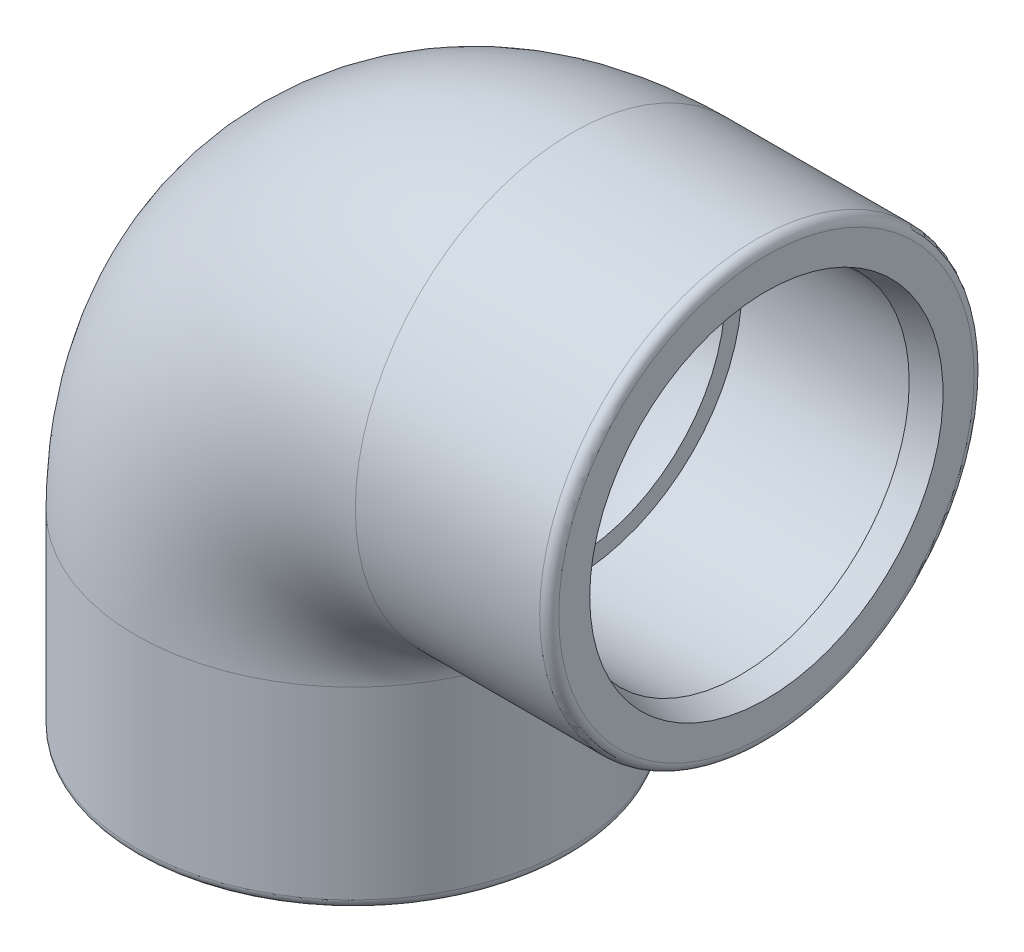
ISO-10303-21;
HEADER;
FILE_DESCRIPTION(('STEP AP214'),'2;1');
FILE_NAME('part.step','',(''),(''),'','','');
FILE_SCHEMA(('AUTOMOTIVE_DESIGN { 1 0 10303 214 1 1 1 1 }'));
ENDSEC;
DATA;
#1=APPLICATION_CONTEXT('core data for automotive mechanical design processes');
#2=APPLICATION_PROTOCOL_DEFINITION('international standard','automotive_design',2000,#1);
#3=PRODUCT_CONTEXT('',#1,'mechanical');
#4=PRODUCT('Part','Part','',(#3));
#5=PRODUCT_RELATED_PRODUCT_CATEGORY('part','',(#4));
#6=PRODUCT_DEFINITION_FORMATION('','',#4);
#7=PRODUCT_DEFINITION_CONTEXT('part definition',#1,'design');
#8=PRODUCT_DEFINITION('design','',#6,#7);
#9=PRODUCT_DEFINITION_SHAPE('','',#8);
#10=(LENGTH_UNIT() NAMED_UNIT(*) SI_UNIT(.MILLI.,.METRE.));
#11=(NAMED_UNIT(*) PLANE_ANGLE_UNIT() SI_UNIT($,.RADIAN.));
#12=(NAMED_UNIT(*) SI_UNIT($,.STERADIAN.) SOLID_ANGLE_UNIT());
#13=UNCERTAINTY_MEASURE_WITH_UNIT(LENGTH_MEASURE(1.E-05),#10,'distance_accuracy_value','');
#14=(GEOMETRIC_REPRESENTATION_CONTEXT(3) GLOBAL_UNCERTAINTY_ASSIGNED_CONTEXT((#13)) GLOBAL_UNIT_ASSIGNED_CONTEXT((#10,
#11,#12)) REPRESENTATION_CONTEXT('',''));
#15=CARTESIAN_POINT('',(0.,0.,0.));
#16=DIRECTION('',(0.,0.,1.));
#17=DIRECTION('',(1.,0.,0.));
#18=AXIS2_PLACEMENT_3D('',#15,#16,#17);
#19=CARTESIAN_POINT('',(-20.705,0.,0.));
#20=DIRECTION('',(0.,1.,0.));
#21=DIRECTION('',(0.,0.,-1.));
#22=AXIS2_PLACEMENT_3D('',#19,#20,#21);
#23=PLANE('',#22);
#24=CARTESIAN_POINT('',(-20.705,0.,0.));
#25=DIRECTION('',(0.,1.,0.));
#26=DIRECTION('',(1.,0.,0.));
#27=AXIS2_PLACEMENT_3D('',#24,#25,#26);
#28=CIRCLE('',#27,14.4);
#29=CARTESIAN_POINT('',(-35.105,0.,0.));
#30=VERTEX_POINT('',#29);
#31=EDGE_CURVE('E133',#30,#30,#28,.F.);
#32=ORIENTED_EDGE('',*,*,#31,.F.);
#33=EDGE_LOOP('',(#32));
#34=FACE_BOUND('',#33,.T.);
#35=CARTESIAN_POINT('',(-20.705,0.,0.));
#36=DIRECTION('',(0.,-1.,0.));
#37=DIRECTION('',(0.,0.,-1.));
#38=AXIS2_PLACEMENT_3D('',#35,#36,#37);
#39=CIRCLE('',#38,16.);
#40=CARTESIAN_POINT('',(-20.705,0.,-16.));
#41=VERTEX_POINT('',#40);
#42=EDGE_CURVE('E141',#41,#41,#39,.T.);
#43=ORIENTED_EDGE('',*,*,#42,.T.);
#44=EDGE_LOOP('',(#43));
#45=FACE_BOUND('',#44,.T.);
#46=ADVANCED_FACE('F43',(#34,#45),#23,.F.);
#47=CARTESIAN_POINT('',(18.295,20.705,0.));
#48=DIRECTION('',(-1.,0.,0.));
#49=DIRECTION('',(0.,0.,1.));
#50=AXIS2_PLACEMENT_3D('',#47,#48,#49);
#51=PLANE('',#50);
#52=CARTESIAN_POINT('',(18.295,20.705,0.));
#53=DIRECTION('',(-1.,0.,0.));
#54=DIRECTION('',(0.,0.,1.));
#55=AXIS2_PLACEMENT_3D('',#52,#53,#54);
#56=CIRCLE('',#55,19.6);
#57=CARTESIAN_POINT('',(18.295,20.705,19.6));
#58=VERTEX_POINT('',#57);
#59=EDGE_CURVE('E58',#58,#58,#56,.F.);
#60=ORIENTED_EDGE('',*,*,#59,.T.);
#61=EDGE_LOOP('',(#60));
#62=FACE_BOUND('',#61,.T.);
#63=CARTESIAN_POINT('',(18.295,20.705,0.));
#64=DIRECTION('',(-1.,0.,0.));
#65=DIRECTION('',(0.,0.,1.));
#66=AXIS2_PLACEMENT_3D('',#63,#64,#65);
#67=CIRCLE('',#66,16.675);
#68=CARTESIAN_POINT('',(18.295,20.705,16.675));
#69=VERTEX_POINT('',#68);
#70=EDGE_CURVE('E63',#69,#69,#67,.T.);
#71=ORIENTED_EDGE('',*,*,#70,.T.);
#72=EDGE_LOOP('',(#71));
#73=FACE_BOUND('',#72,.T.);
#74=ADVANCED_FACE('F163',(#62,#73),#51,.F.);
#75=CARTESIAN_POINT('',(0.,0.,0.));
#76=DIRECTION('',(0.,0.,-1.));
#77=DIRECTION('',(0.,-1.,0.));
#78=AXIS2_PLACEMENT_3D('',#75,#76,#77);
#79=TOROIDAL_SURFACE('',#78,20.705,20.5);
#80=CARTESIAN_POINT('',(-20.705,0.,0.));
#81=DIRECTION('',(0.,-1.,0.));
#82=DIRECTION('',(1.,0.,0.));
#83=AXIS2_PLACEMENT_3D('',#80,#81,#82);
#84=CIRCLE('',#83,20.5);
#85=CARTESIAN_POINT('',(-41.205,0.,0.));
#86=VERTEX_POINT('',#85);
#87=EDGE_CURVE('E80',#86,#86,#84,.T.);
#88=CARTESIAN_POINT('',(0.,20.705,0.));
#89=DIRECTION('',(1.,0.,0.));
#90=DIRECTION('',(0.,-1.,0.));
#91=AXIS2_PLACEMENT_3D('',#88,#89,#90);
#92=CIRCLE('',#91,20.5);
#93=CARTESIAN_POINT('',(0.,41.205,0.));
#94=VERTEX_POINT('',#93);
#95=EDGE_CURVE('E75',#94,#94,#92,.T.);
#96=CARTESIAN_POINT('',(0.,0.,0.));
#97=DIRECTION('',(0.,0.,-1.));
#98=DIRECTION('',(0.,-1.,0.));
#99=AXIS2_PLACEMENT_3D('',#96,#97,#98);
#100=CIRCLE('',#99,41.205);
#101=EDGE_CURVE('',#86,#94,#100,.T.);
#102=ORIENTED_EDGE('',*,*,#87,.F.);
#103=ORIENTED_EDGE('',*,*,#95,.F.);
#104=ORIENTED_EDGE('',*,*,#101,.T.);
#105=ORIENTED_EDGE('',*,*,#101,.F.);
#106=EDGE_LOOP('',(#102,#104,#103,#105));
#107=FACE_BOUND('',#106,.T.);
#108=ADVANCED_FACE('F169',(#107),#79,.T.);
#109=CARTESIAN_POINT('',(22.,20.705,0.));
#110=DIRECTION('',(-1.,0.,0.));
#111=DIRECTION('',(0.,-1.,0.));
#112=AXIS2_PLACEMENT_3D('',#109,#110,#111);
#113=CYLINDRICAL_SURFACE('',#112,20.5);
#114=CARTESIAN_POINT('',(17.395,20.705,0.));
#115=DIRECTION('',(-1.,0.,0.));
#116=DIRECTION('',(0.,0.,1.));
#117=AXIS2_PLACEMENT_3D('',#114,#115,#116);
#118=CIRCLE('',#117,20.5);
#119=CARTESIAN_POINT('',(17.395,20.705,20.5));
#120=VERTEX_POINT('',#119);
#121=EDGE_CURVE('E54',#120,#120,#118,.T.);
#122=ORIENTED_EDGE('',*,*,#121,.T.);
#123=EDGE_LOOP('',(#122));
#124=FACE_BOUND('',#123,.T.);
#125=ORIENTED_EDGE('',*,*,#95,.T.);
#126=EDGE_LOOP('',(#125));
#127=FACE_BOUND('',#126,.T.);
#128=ADVANCED_FACE('F182',(#124,#127),#113,.T.);
#129=CARTESIAN_POINT('',(22.,20.705,0.));
#130=DIRECTION('',(-1.,0.,0.));
#131=DIRECTION('',(0.,-1.,0.));
#132=AXIS2_PLACEMENT_3D('',#129,#130,#131);
#133=CYLINDRICAL_SURFACE('',#132,16.);
#134=CARTESIAN_POINT('',(15.7758657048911,20.705,0.));
#135=DIRECTION('',(-1.,0.,0.));
#136=DIRECTION('',(0.,0.,1.));
#137=AXIS2_PLACEMENT_3D('',#134,#135,#136);
#138=CIRCLE('',#137,16.);
#139=CARTESIAN_POINT('',(15.7758657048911,20.705,16.));
#140=VERTEX_POINT('',#139);
#141=EDGE_CURVE('E66',#140,#140,#138,.F.);
#142=ORIENTED_EDGE('',*,*,#141,.T.);
#143=EDGE_LOOP('',(#142));
#144=FACE_BOUND('',#143,.T.);
#145=CARTESIAN_POINT('',(0.,20.705,0.));
#146=DIRECTION('',(1.,0.,0.));
#147=DIRECTION('',(0.,-1.,0.));
#148=AXIS2_PLACEMENT_3D('',#145,#146,#147);
#149=CIRCLE('',#148,16.);
#150=CARTESIAN_POINT('',(0.,4.705,0.));
#151=VERTEX_POINT('',#150);
#152=EDGE_CURVE('E128',#151,#151,#149,.T.);
#153=ORIENTED_EDGE('',*,*,#152,.F.);
#154=EDGE_LOOP('',(#153));
#155=FACE_BOUND('',#154,.T.);
#156=ADVANCED_FACE('F179',(#144,#155),#133,.F.);
#157=CARTESIAN_POINT('',(0.,20.705,0.));
#158=DIRECTION('',(-1.,0.,0.));
#159=DIRECTION('',(0.,0.,1.));
#160=AXIS2_PLACEMENT_3D('',#157,#158,#159);
#161=PLANE('',#160);
#162=CARTESIAN_POINT('',(0.,20.705,0.));
#163=DIRECTION('',(-1.,0.,0.));
#164=DIRECTION('',(0.,0.,1.));
#165=AXIS2_PLACEMENT_3D('',#162,#163,#164);
#166=CIRCLE('',#165,14.4);
#167=CARTESIAN_POINT('',(0.,35.105,0.));
#168=VERTEX_POINT('',#167);
#169=EDGE_CURVE('E137',#168,#168,#166,.F.);
#170=ORIENTED_EDGE('',*,*,#169,.F.);
#171=EDGE_LOOP('',(#170));
#172=FACE_BOUND('',#171,.T.);
#173=ORIENTED_EDGE('',*,*,#152,.T.);
#174=EDGE_LOOP('',(#173));
#175=FACE_BOUND('',#174,.T.);
#176=ADVANCED_FACE('F176',(#172,#175),#161,.F.);
#177=CARTESIAN_POINT('',(0.,0.,0.));
#178=DIRECTION('',(0.,0.,-1.));
#179=DIRECTION('',(0.,-1.,0.));
#180=AXIS2_PLACEMENT_3D('',#177,#178,#179);
#181=TOROIDAL_SURFACE('',#180,20.705,14.4);
#182=CARTESIAN_POINT('',(0.,0.,0.));
#183=DIRECTION('',(0.,0.,-1.));
#184=DIRECTION('',(0.,-1.,0.));
#185=AXIS2_PLACEMENT_3D('',#182,#183,#184);
#186=CIRCLE('',#185,35.105);
#187=EDGE_CURVE('',#30,#168,#186,.T.);
#188=ORIENTED_EDGE('',*,*,#31,.T.);
#189=ORIENTED_EDGE('',*,*,#169,.T.);
#190=ORIENTED_EDGE('',*,*,#187,.T.);
#191=ORIENTED_EDGE('',*,*,#187,.F.);
#192=EDGE_LOOP('',(#188,#190,#189,#191));
#193=FACE_BOUND('',#192,.T.);
#194=ADVANCED_FACE('F175',(#193),#181,.F.);
#195=CARTESIAN_POINT('',(-20.705,-18.295,0.));
#196=DIRECTION('',(0.,-1.,0.));
#197=DIRECTION('',(0.,0.,-1.));
#198=AXIS2_PLACEMENT_3D('',#195,#196,#197);
#199=PLANE('',#198);
#200=CARTESIAN_POINT('',(-20.705,-18.295,0.));
#201=DIRECTION('',(0.,-1.,0.));
#202=DIRECTION('',(0.,0.,-1.));
#203=AXIS2_PLACEMENT_3D('',#200,#201,#202);
#204=CIRCLE('',#203,19.6);
#205=CARTESIAN_POINT('',(-20.705,-18.295,-19.6));
#206=VERTEX_POINT('',#205);
#207=EDGE_CURVE('E50',#206,#206,#204,.T.);
#208=ORIENTED_EDGE('',*,*,#207,.T.);
#209=EDGE_LOOP('',(#208));
#210=FACE_BOUND('',#209,.T.);
#211=CARTESIAN_POINT('',(-20.705,-18.295,0.));
#212=DIRECTION('',(0.,-1.,0.));
#213=DIRECTION('',(0.,0.,-1.));
#214=AXIS2_PLACEMENT_3D('',#211,#212,#213);
#215=CIRCLE('',#214,16.675);
#216=CARTESIAN_POINT('',(-20.705,-18.295,-16.675));
#217=VERTEX_POINT('',#216);
#218=EDGE_CURVE('E69',#217,#217,#215,.F.);
#219=ORIENTED_EDGE('',*,*,#218,.T.);
#220=EDGE_LOOP('',(#219));
#221=FACE_BOUND('',#220,.T.);
#222=ADVANCED_FACE('F159',(#210,#221),#199,.T.);
#223=CARTESIAN_POINT('',(-20.705,-18.295,0.));
#224=DIRECTION('',(0.,1.,0.));
#225=DIRECTION('',(0.,0.,1.));
#226=AXIS2_PLACEMENT_3D('',#223,#224,#225);
#227=CYLINDRICAL_SURFACE('',#226,20.5);
#228=CARTESIAN_POINT('',(-20.705,-17.395,0.));
#229=DIRECTION('',(0.,-1.,0.));
#230=DIRECTION('',(0.,0.,-1.));
#231=AXIS2_PLACEMENT_3D('',#228,#229,#230);
#232=CIRCLE('',#231,20.5);
#233=CARTESIAN_POINT('',(-20.705,-17.395,-20.5));
#234=VERTEX_POINT('',#233);
#235=EDGE_CURVE('E11',#234,#234,#232,.F.);
#236=ORIENTED_EDGE('',*,*,#235,.T.);
#237=EDGE_LOOP('',(#236));
#238=FACE_BOUND('',#237,.T.);
#239=ORIENTED_EDGE('',*,*,#87,.T.);
#240=EDGE_LOOP('',(#239));
#241=FACE_BOUND('',#240,.T.);
#242=ADVANCED_FACE('F149',(#238,#241),#227,.T.);
#243=CARTESIAN_POINT('',(-20.705,-18.295,0.));
#244=DIRECTION('',(0.,1.,0.));
#245=DIRECTION('',(0.,0.,1.));
#246=AXIS2_PLACEMENT_3D('',#243,#244,#245);
#247=CYLINDRICAL_SURFACE('',#246,16.);
#248=CARTESIAN_POINT('',(-20.705,-15.7758657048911,0.));
#249=DIRECTION('',(0.,-1.,0.));
#250=DIRECTION('',(0.,0.,-1.));
#251=AXIS2_PLACEMENT_3D('',#248,#249,#250);
#252=CIRCLE('',#251,16.);
#253=CARTESIAN_POINT('',(-20.705,-15.7758657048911,-16.));
#254=VERTEX_POINT('',#253);
#255=EDGE_CURVE('E72',#254,#254,#252,.T.);
#256=ORIENTED_EDGE('',*,*,#255,.T.);
#257=EDGE_LOOP('',(#256));
#258=FACE_BOUND('',#257,.T.);
#259=ORIENTED_EDGE('',*,*,#42,.F.);
#260=EDGE_LOOP('',(#259));
#261=FACE_BOUND('',#260,.T.);
#262=ADVANCED_FACE('F146',(#258,#261),#247,.F.);
#263=CARTESIAN_POINT('',(-20.705,-15.7758657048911,0.));
#264=DIRECTION('',(0.,-1.,0.));
#265=DIRECTION('',(0.,0.,-1.));
#266=AXIS2_PLACEMENT_3D('',#263,#264,#265);
#267=CONICAL_SURFACE('',#266,16.,0.261799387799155);
#268=CARTESIAN_POINT('',(-20.705,-18.295,-16.675));
#269=CARTESIAN_POINT('',(-20.705,-18.2687590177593,-16.66796875));
#270=CARTESIAN_POINT('',(-20.705,-18.2425180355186,-16.6609375));
#271=CARTESIAN_POINT('',(-20.705,-18.1900360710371,-16.646875));
#272=CARTESIAN_POINT('',(-20.705,-18.1637950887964,-16.63984375));
#273=CARTESIAN_POINT('',(-20.705,-18.111313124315,-16.62578125));
#274=CARTESIAN_POINT('',(-20.705,-18.0850721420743,-16.61875));
#275=CARTESIAN_POINT('',(-20.705,-18.0325901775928,-16.6046875));
#276=CARTESIAN_POINT('',(-20.705,-18.0063491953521,-16.59765625));
#277=CARTESIAN_POINT('',(-20.705,-17.9538672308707,-16.58359375));
#278=CARTESIAN_POINT('',(-20.705,-17.9276262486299,-16.5765625));
#279=CARTESIAN_POINT('',(-20.705,-17.8751442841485,-16.5625));
#280=CARTESIAN_POINT('',(-20.705,-17.8489033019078,-16.55546875));
#281=CARTESIAN_POINT('',(-20.705,-17.7964213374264,-16.54140625));
#282=CARTESIAN_POINT('',(-20.705,-17.7701803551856,-16.534375));
#283=CARTESIAN_POINT('',(-20.705,-17.7176983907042,-16.5203125));
#284=CARTESIAN_POINT('',(-20.705,-17.6914574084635,-16.51328125));
#285=CARTESIAN_POINT('',(-20.705,-17.6389754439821,-16.49921875));
#286=CARTESIAN_POINT('',(-20.705,-17.6127344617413,-16.4921875));
#287=CARTESIAN_POINT('',(-20.705,-17.5602524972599,-16.478125));
#288=CARTESIAN_POINT('',(-20.705,-17.5340115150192,-16.47109375));
#289=CARTESIAN_POINT('',(-20.705,-17.4815295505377,-16.45703125));
#290=CARTESIAN_POINT('',(-20.705,-17.455288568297,-16.45));
#291=CARTESIAN_POINT('',(-20.705,-17.4028066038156,-16.4359375));
#292=CARTESIAN_POINT('',(-20.705,-17.3765656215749,-16.42890625));
#293=CARTESIAN_POINT('',(-20.705,-17.3240836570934,-16.41484375));
#294=CARTESIAN_POINT('',(-20.705,-17.2978426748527,-16.4078125));
#295=CARTESIAN_POINT('',(-20.705,-17.2453607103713,-16.39375));
#296=CARTESIAN_POINT('',(-20.705,-17.2191197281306,-16.38671875));
#297=CARTESIAN_POINT('',(-20.705,-17.1666377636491,-16.37265625));
#298=CARTESIAN_POINT('',(-20.705,-17.1403967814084,-16.365625));
#299=CARTESIAN_POINT('',(-20.705,-17.087914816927,-16.3515625));
#300=CARTESIAN_POINT('',(-20.705,-17.0616738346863,-16.34453125));
#301=CARTESIAN_POINT('',(-20.705,-17.0091918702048,-16.33046875));
#302=CARTESIAN_POINT('',(-20.705,-16.9829508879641,-16.3234375));
#303=CARTESIAN_POINT('',(-20.705,-16.9304689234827,-16.309375));
#304=CARTESIAN_POINT('',(-20.705,-16.9042279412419,-16.30234375));
#305=CARTESIAN_POINT('',(-20.705,-16.8517459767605,-16.28828125));
#306=CARTESIAN_POINT('',(-20.705,-16.8255049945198,-16.28125));
#307=CARTESIAN_POINT('',(-20.705,-16.7730230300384,-16.2671875));
#308=CARTESIAN_POINT('',(-20.705,-16.7467820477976,-16.26015625));
#309=CARTESIAN_POINT('',(-20.705,-16.6943000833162,-16.24609375));
#310=CARTESIAN_POINT('',(-20.705,-16.6680591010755,-16.2390625));
#311=CARTESIAN_POINT('',(-20.705,-16.6155771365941,-16.225));
#312=CARTESIAN_POINT('',(-20.705,-16.5893361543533,-16.21796875));
#313=CARTESIAN_POINT('',(-20.705,-16.5368541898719,-16.20390625));
#314=CARTESIAN_POINT('',(-20.705,-16.5106132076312,-16.196875));
#315=CARTESIAN_POINT('',(-20.705,-16.4581312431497,-16.1828125));
#316=CARTESIAN_POINT('',(-20.705,-16.431890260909,-16.17578125));
#317=CARTESIAN_POINT('',(-20.705,-16.3794082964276,-16.16171875));
#318=CARTESIAN_POINT('',(-20.705,-16.3531673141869,-16.1546875));
#319=CARTESIAN_POINT('',(-20.705,-16.3006853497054,-16.140625));
#320=CARTESIAN_POINT('',(-20.705,-16.2744443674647,-16.13359375));
#321=CARTESIAN_POINT('',(-20.705,-16.2219624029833,-16.11953125));
#322=CARTESIAN_POINT('',(-20.705,-16.1957214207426,-16.1125));
#323=CARTESIAN_POINT('',(-20.705,-16.1432394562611,-16.0984375));
#324=CARTESIAN_POINT('',(-20.705,-16.1169984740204,-16.09140625));
#325=CARTESIAN_POINT('',(-20.705,-16.064516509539,-16.07734375));
#326=CARTESIAN_POINT('',(-20.705,-16.0382755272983,-16.0703125));
#327=CARTESIAN_POINT('',(-20.705,-15.9857935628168,-16.05625));
#328=CARTESIAN_POINT('',(-20.705,-15.9595525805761,-16.04921875));
#329=CARTESIAN_POINT('',(-20.705,-15.9070706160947,-16.03515625));
#330=CARTESIAN_POINT('',(-20.705,-15.880829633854,-16.028125));
#331=CARTESIAN_POINT('',(-20.705,-15.8283476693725,-16.0140625));
#332=CARTESIAN_POINT('',(-20.705,-15.8021066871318,-16.00703125));
#333=CARTESIAN_POINT('',(-20.705,-15.7758657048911,-16.));
#334=B_SPLINE_CURVE_WITH_KNOTS('',3,(#268,#269,#270,#271,#272,#273,#274,#275,#276,#277,#278,
#279,#280,#281,#282,#283,#284,#285,#286,#287,#288,#289,#290,#291,#292,#293,#294,#295,#296,#297,
#298,#299,#300,#301,#302,#303,#304,#305,#306,#307,#308,#309,#310,#311,#312,#313,#314,#315,#316,
#317,#318,#319,#320,#321,#322,#323,#324,#325,#326,#327,#328,#329,#330,#331,#332,#333),
.UNSPECIFIED.,.F.,.F.,(4,2,2,2,2,2,2,2,2,2,2,2,2,2,2,2,2,2,2,2,2,2,2,2,2,2,2,2,2,2,2,2,4),(0.,
0.081499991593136,0.162999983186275,0.244499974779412,0.325999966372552,0.407499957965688,
0.488999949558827,0.570499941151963,0.651999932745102,0.733499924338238,0.814999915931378,
0.896499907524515,0.977999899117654,1.05949989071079,1.14099988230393,1.22249987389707,
1.3039998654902,1.38549985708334,1.46699984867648,1.54849984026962,1.62999983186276,
1.71149982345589,1.79299981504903,1.87449980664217,1.95599979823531,2.03749978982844,
2.11899978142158,2.20049977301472,2.28199976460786,2.36349975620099,2.44499974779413,
2.52649973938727,2.60799973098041),.UNSPECIFIED.);
#335=EDGE_CURVE('BSEAM148',#217,#254,#334,.T.);
#336=ORIENTED_EDGE('',*,*,#218,.F.);
#337=ORIENTED_EDGE('',*,*,#255,.F.);
#338=ORIENTED_EDGE('',*,*,#335,.T.);
#339=ORIENTED_EDGE('',*,*,#335,.F.);
#340=EDGE_LOOP('',(#336,#338,#337,#339));
#341=FACE_BOUND('',#340,.T.);
#342=ADVANCED_FACE('F148',(#341),#267,.F.);
#343=CARTESIAN_POINT('',(15.7758657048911,20.705,0.));
#344=DIRECTION('',(1.,0.,0.));
#345=DIRECTION('',(0.,0.,-1.));
#346=AXIS2_PLACEMENT_3D('',#343,#344,#345);
#347=CONICAL_SURFACE('',#346,16.,0.261799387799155);
#348=ORIENTED_EDGE('',*,*,#70,.F.);
#349=EDGE_LOOP('',(#348));
#350=FACE_BOUND('',#349,.T.);
#351=ORIENTED_EDGE('',*,*,#141,.F.);
#352=EDGE_LOOP('',(#351));
#353=FACE_BOUND('',#352,.T.);
#354=ADVANCED_FACE('F156',(#350,#353),#347,.F.);
#355=CARTESIAN_POINT('',(17.395,20.705,0.));
#356=DIRECTION('',(-1.,0.,0.));
#357=DIRECTION('',(0.,0.,1.));
#358=AXIS2_PLACEMENT_3D('',#355,#356,#357);
#359=TOROIDAL_SURFACE('',#358,19.6,0.9);
#360=ORIENTED_EDGE('',*,*,#121,.F.);
#361=EDGE_LOOP('',(#360));
#362=FACE_BOUND('',#361,.T.);
#363=ORIENTED_EDGE('',*,*,#59,.F.);
#364=EDGE_LOOP('',(#363));
#365=FACE_BOUND('',#364,.T.);
#366=ADVANCED_FACE('F192',(#362,#365),#359,.T.);
#367=CARTESIAN_POINT('',(-20.705,-17.395,0.));
#368=DIRECTION('',(0.,-1.,0.));
#369=DIRECTION('',(0.,0.,-1.));
#370=AXIS2_PLACEMENT_3D('',#367,#368,#369);
#371=TOROIDAL_SURFACE('',#370,19.6,0.9);
#372=ORIENTED_EDGE('',*,*,#235,.F.);
#373=EDGE_LOOP('',(#372));
#374=FACE_BOUND('',#373,.T.);
#375=ORIENTED_EDGE('',*,*,#207,.F.);
#376=EDGE_LOOP('',(#375));
#377=FACE_BOUND('',#376,.T.);
#378=ADVANCED_FACE('F45',(#374,#377),#371,.T.);
#379=CLOSED_SHELL('',(#46,#74,#108,#128,#156,#176,#194,#222,#242,#262,#342,#354,#366,#378));
#380=MANIFOLD_SOLID_BREP('B2',#379);
#381=ADVANCED_BREP_SHAPE_REPRESENTATION('',(#18,#380),#14);
#382=SHAPE_DEFINITION_REPRESENTATION(#9,#381);
ENDSEC;
END-ISO-10303-21;
